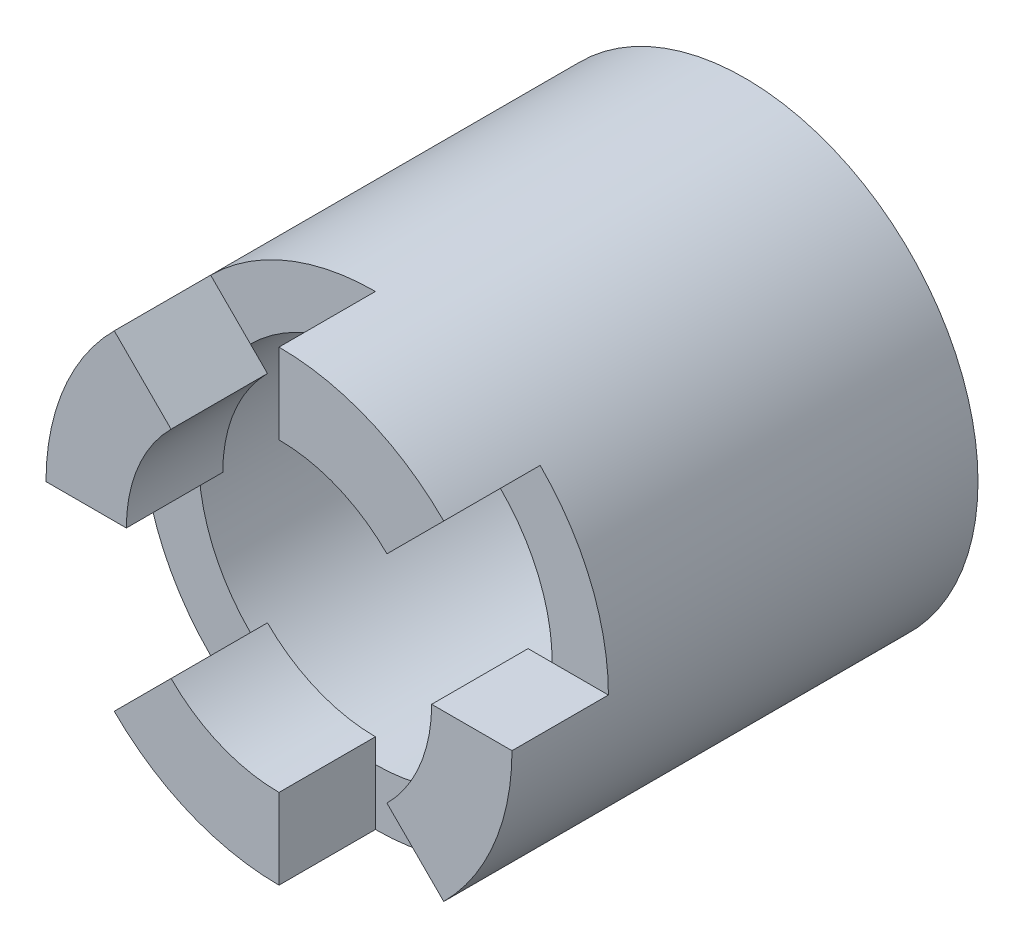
from build123d import *

# Parameters (mm, degrees)
SKETCH1_R           = 7.25
BOSS_EXTRUDE1_DEPTH = 11.5
SKETCH2_R           = 5.5
CUT_EXTRUDE1_DEPTH  = 9
BOSS_EXTRUDE2_DEPTH = 3


with BuildPart() as part:
    # Sketch1 → Boss-Extrude1 (new body)
    with BuildSketch(Plane.XY):
        Circle(SKETCH1_R)
    extrude(amount=BOSS_EXTRUDE1_DEPTH)

    # Sketch2 → Cut-Extrude1 (cut)
    with BuildSketch(Plane.XY.offset(11.5)):
        Circle(SKETCH2_R)
    extrude(amount=-CUT_EXTRUDE1_DEPTH, mode=Mode.SUBTRACT)

    # Sketch3 → Boss-Extrude2 (add)
    with BuildSketch(Plane.XY.offset(11.5)):
        with BuildLine():
            Line((0, 7.25), (0, 4.75))
            ThreePointArc((0, 4.75), (1.817746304, 4.388427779), (3.358757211, 3.358757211))
            Line((3.358757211, 3.358757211), (5.126524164, 5.126524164))
            ThreePointArc((5.126524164, 5.126524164), (2.774454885, 6.698126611), (0, 7.25))
        make_face()
        with BuildLine():
            Line((-7.25, 0), (-4.75, 0))
            ThreePointArc((-4.75, 0), (-4.388427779, 1.817746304), (-3.358757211, 3.358757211))
            Line((-3.358757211, 3.358757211), (-5.126524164, 5.126524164))
            ThreePointArc((-5.126524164, 5.126524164), (-6.698126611, 2.774454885), (-7.25, 0))
        make_face()
        with BuildLine():
            Line((-5.126524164, -5.126524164), (-3.358757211, -3.358757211))
            ThreePointArc((-3.358757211, -3.358757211), (-1.817746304, -4.388427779), (0, -4.75))
            Line((0, -4.75), (0, -7.25))
            ThreePointArc((0, -7.25), (-2.774454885, -6.698126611), (-5.126524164, -5.126524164))
        make_face()
        with BuildLine():
            Line((3.358757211, -3.358757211), (5.126524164, -5.126524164))
            ThreePointArc((5.126524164, -5.126524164), (6.698126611, -2.774454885), (7.25, 0))
            Line((7.25, 0), (4.75, 0))
            ThreePointArc((4.75, 0), (4.388427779, -1.817746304), (3.358757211, -3.358757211))
        make_face()
    extrude(amount=BOSS_EXTRUDE2_DEPTH)


solid = part.part
